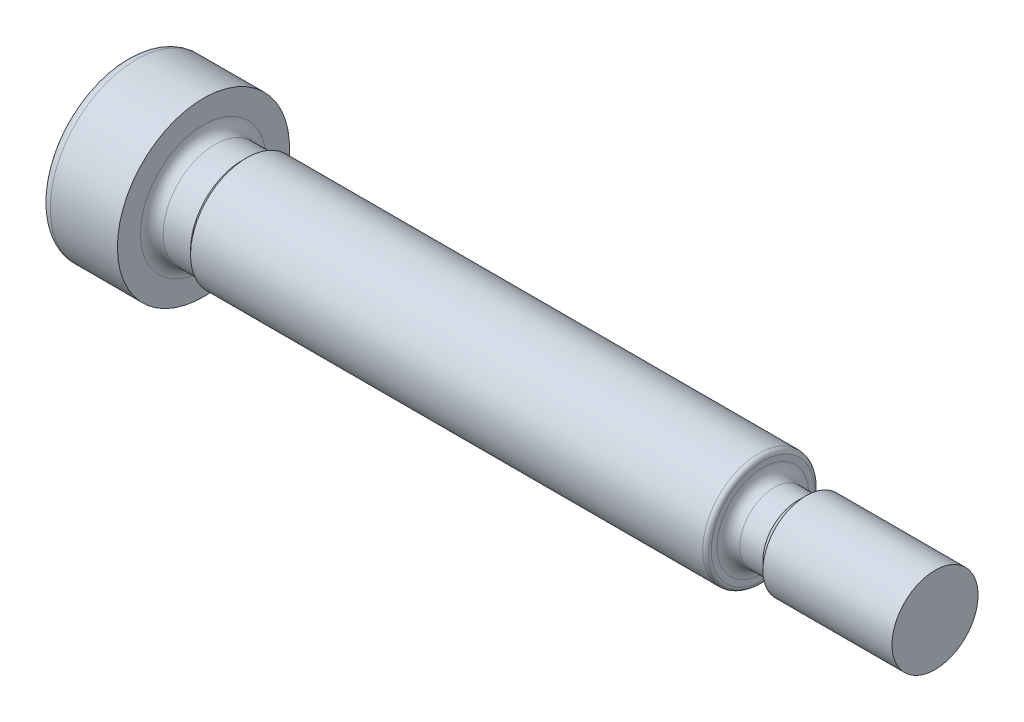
from build123d import *

# Parameters (mm, degrees)
FILLET1_R          = 0.66
FILLET3_R          = 0.6
CUT_EXTRUDE1_DEPTH = 3.5
FILLET4_R          = 0.25


with BuildPart() as part:
    # Sketch1 → Revolve1 (revolve)
    with BuildSketch(Plane.XY, mode=Mode.PRIVATE) as revolve1_sk:
        Polygon((0, 0), (0, 5), (4.5, 5), (4.5, 3), (6.75, 3), (7, 3.25), (37, 3.25), (37, 2), (39, 2), (39.5, 2.5), (47, 2.5), (47, 0), align=None)
    revolve(revolve1_sk.sketch.rotate(Axis((0, 0, 0), (1, 0, 0)), 90), axis=Axis((0, 0, 0), (1, 0, 0)))

    # Fillet1
    fillet1_edges = [part.edges().sort_by_distance(p)[0] for p in [
        (37, 0, -2),
        (4.5, 0, -3),
    ]]
    fillet(fillet1_edges, radius=FILLET1_R)

    # Fillet3
    fillet3_edges = [part.edges().sort_by_distance(p)[0] for p in [
        (0, 0, -5),
    ]]
    fillet(fillet3_edges, radius=FILLET3_R)

    # Sketch2 → Cut-Extrude1 (cut)
    with BuildSketch(Plane.ZY):
        Polygon((-1.732050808, 0), (-0.866025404, -1.5), (0.866025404, -1.5), (1.732050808, 0), (0.866025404, 1.5), (-0.866025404, 1.5), align=None)
    extrude(amount=-CUT_EXTRUDE1_DEPTH, mode=Mode.SUBTRACT)

    # Fillet4
    fillet4_edges = [part.edges().sort_by_distance(p)[0] for p in [
        (37, 0, -3.25),
    ]]
    fillet(fillet4_edges, radius=FILLET4_R)


solid = part.part
